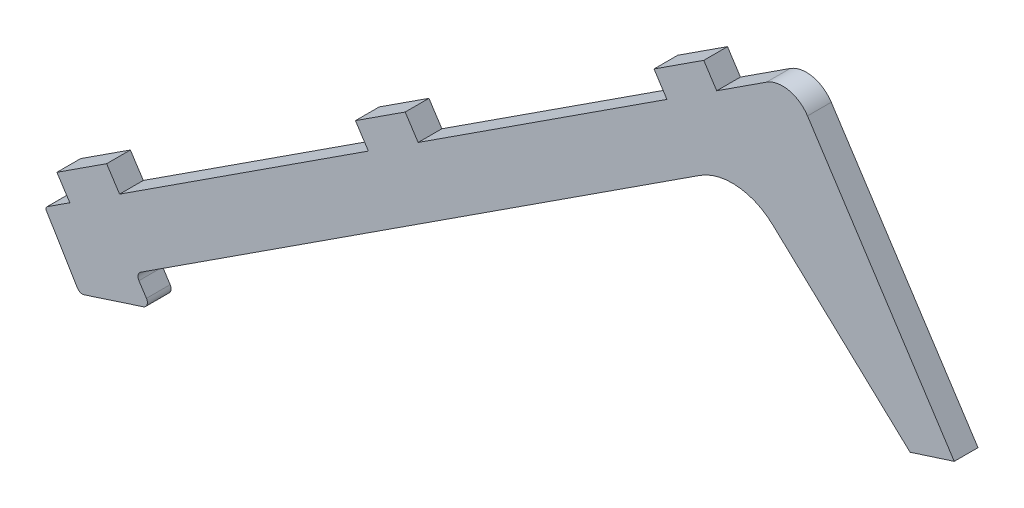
ISO-10303-21;
HEADER;
FILE_DESCRIPTION(('STEP AP214'),'2;1');
FILE_NAME('part.step','',(''),(''),'','','');
FILE_SCHEMA(('AUTOMOTIVE_DESIGN { 1 0 10303 214 1 1 1 1 }'));
ENDSEC;
DATA;
#1=APPLICATION_CONTEXT('core data for automotive mechanical design processes');
#2=APPLICATION_PROTOCOL_DEFINITION('international standard','automotive_design',2000,#1);
#3=PRODUCT_CONTEXT('',#1,'mechanical');
#4=PRODUCT('Part','Part','',(#3));
#5=PRODUCT_RELATED_PRODUCT_CATEGORY('part','',(#4));
#6=PRODUCT_DEFINITION_FORMATION('','',#4);
#7=PRODUCT_DEFINITION_CONTEXT('part definition',#1,'design');
#8=PRODUCT_DEFINITION('design','',#6,#7);
#9=PRODUCT_DEFINITION_SHAPE('','',#8);
#10=(LENGTH_UNIT() NAMED_UNIT(*) SI_UNIT(.MILLI.,.METRE.));
#11=(NAMED_UNIT(*) PLANE_ANGLE_UNIT() SI_UNIT($,.RADIAN.));
#12=(NAMED_UNIT(*) SI_UNIT($,.STERADIAN.) SOLID_ANGLE_UNIT());
#13=UNCERTAINTY_MEASURE_WITH_UNIT(LENGTH_MEASURE(1.E-05),#10,'distance_accuracy_value','');
#14=(GEOMETRIC_REPRESENTATION_CONTEXT(3) GLOBAL_UNCERTAINTY_ASSIGNED_CONTEXT((#13)) GLOBAL_UNIT_ASSIGNED_CONTEXT((#10,
#11,#12)) REPRESENTATION_CONTEXT('',''));
#15=CARTESIAN_POINT('',(0.,0.,0.));
#16=DIRECTION('',(0.,0.,1.));
#17=DIRECTION('',(1.,0.,0.));
#18=AXIS2_PLACEMENT_3D('',#15,#16,#17);
#19=CARTESIAN_POINT('',(141.204421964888,60.2777769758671,8.));
#20=DIRECTION('',(0.,0.,-1.));
#21=DIRECTION('',(-1.,0.,0.));
#22=AXIS2_PLACEMENT_3D('',#19,#20,#21);
#23=CYLINDRICAL_SURFACE('',#22,20.0000000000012);
#24=CARTESIAN_POINT('',(141.204421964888,60.2777769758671,0.));
#25=DIRECTION('',(0.,0.,-1.));
#26=DIRECTION('',(-1.,0.,0.));
#27=AXIS2_PLACEMENT_3D('',#24,#25,#26);
#28=CIRCLE('',#27,20.0000000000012);
#29=CARTESIAN_POINT('',(130.30586040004,77.0474327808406,0.));
#30=VERTEX_POINT('',#29);
#31=CARTESIAN_POINT('',(154.853758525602,74.8961083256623,0.));
#32=VERTEX_POINT('',#31);
#33=EDGE_CURVE('E237',#30,#32,#28,.T.);
#34=ORIENTED_EDGE('',*,*,#33,.T.);
#35=DIRECTION('',(0.,0.,-1.));
#36=VECTOR('',#35,1.);
#37=CARTESIAN_POINT('',(154.853758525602,74.8961083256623,8.));
#38=LINE('',#37,#36);
#39=CARTESIAN_POINT('',(154.853758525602,74.8961083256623,8.));
#40=VERTEX_POINT('',#39);
#41=EDGE_CURVE('E11',#40,#32,#38,.T.);
#42=ORIENTED_EDGE('',*,*,#41,.F.);
#43=CARTESIAN_POINT('',(141.204421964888,60.2777769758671,8.));
#44=DIRECTION('',(0.,0.,-1.));
#45=DIRECTION('',(-1.,0.,0.));
#46=AXIS2_PLACEMENT_3D('',#43,#44,#45);
#47=CIRCLE('',#46,20.0000000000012);
#48=CARTESIAN_POINT('',(130.30586040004,77.0474327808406,8.));
#49=VERTEX_POINT('',#48);
#50=EDGE_CURVE('E288',#49,#40,#47,.T.);
#51=ORIENTED_EDGE('',*,*,#50,.F.);
#52=DIRECTION('',(0.,0.,-1.));
#53=VECTOR('',#52,1.);
#54=CARTESIAN_POINT('',(130.30586040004,77.0474327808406,8.));
#55=LINE('',#54,#53);
#56=EDGE_CURVE('E233',#49,#30,#55,.T.);
#57=ORIENTED_EDGE('',*,*,#56,.T.);
#58=EDGE_LOOP('',(#34,#42,#51,#57));
#59=FACE_BOUND('',#58,.T.);
#60=ADVANCED_FACE('F32',(#59),#23,.F.);
#61=CARTESIAN_POINT('',(196.031751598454,36.4476511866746,8.));
#62=DIRECTION('',(0.682466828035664,0.730916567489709,0.));
#63=DIRECTION('',(-0.730916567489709,0.682466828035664,0.));
#64=AXIS2_PLACEMENT_3D('',#61,#62,#63);
#65=PLANE('',#64);
#66=DIRECTION('',(0.730916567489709,-0.682466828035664,0.));
#67=VECTOR('',#66,1.);
#68=CARTESIAN_POINT('',(196.031751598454,36.4476511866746,0.));
#69=LINE('',#68,#67);
#70=CARTESIAN_POINT('',(201.148167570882,31.670383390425,0.));
#71=VERTEX_POINT('',#70);
#72=EDGE_CURVE('E240',#32,#71,#69,.T.);
#73=ORIENTED_EDGE('',*,*,#72,.T.);
#74=DIRECTION('',(0.,0.,-1.));
#75=VECTOR('',#74,1.);
#76=CARTESIAN_POINT('',(201.148167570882,31.670383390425,8.));
#77=LINE('',#76,#75);
#78=CARTESIAN_POINT('',(201.148167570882,31.670383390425,8.));
#79=VERTEX_POINT('',#78);
#80=EDGE_CURVE('E40',#79,#71,#77,.T.);
#81=ORIENTED_EDGE('',*,*,#80,.F.);
#82=DIRECTION('',(0.730916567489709,-0.682466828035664,0.));
#83=VECTOR('',#82,1.);
#84=CARTESIAN_POINT('',(154.853758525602,74.8961083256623,8.));
#85=LINE('',#84,#83);
#86=EDGE_CURVE('E143',#40,#79,#85,.T.);
#87=ORIENTED_EDGE('',*,*,#86,.F.);
#88=ORIENTED_EDGE('',*,*,#41,.T.);
#89=EDGE_LOOP('',(#73,#81,#87,#88));
#90=FACE_BOUND('',#89,.T.);
#91=ADVANCED_FACE('F426',(#90),#65,.F.);
#92=CARTESIAN_POINT('',(201.148167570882,31.670383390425,8.));
#93=DIRECTION('',(-0.305618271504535,0.95215412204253,0.));
#94=DIRECTION('',(-0.95215412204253,-0.305618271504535,0.));
#95=AXIS2_PLACEMENT_3D('',#92,#93,#94);
#96=PLANE('',#95);
#97=DIRECTION('',(0.95215412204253,0.305618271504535,0.));
#98=VECTOR('',#97,1.);
#99=CARTESIAN_POINT('',(201.148167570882,31.670383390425,0.));
#100=LINE('',#99,#98);
#101=CARTESIAN_POINT('',(216.031751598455,36.4476511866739,0.));
#102=VERTEX_POINT('',#101);
#103=EDGE_CURVE('E242',#71,#102,#100,.T.);
#104=ORIENTED_EDGE('',*,*,#103,.T.);
#105=DIRECTION('',(0.,0.,-1.));
#106=VECTOR('',#105,1.);
#107=CARTESIAN_POINT('',(216.031751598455,36.4476511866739,8.));
#108=LINE('',#107,#106);
#109=CARTESIAN_POINT('',(216.031751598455,36.4476511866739,8.));
#110=VERTEX_POINT('',#109);
#111=EDGE_CURVE('E349',#110,#102,#108,.T.);
#112=ORIENTED_EDGE('',*,*,#111,.F.);
#113=DIRECTION('',(0.95215412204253,0.305618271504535,0.));
#114=VECTOR('',#113,1.);
#115=CARTESIAN_POINT('',(201.148167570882,31.670383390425,8.));
#116=LINE('',#115,#114);
#117=EDGE_CURVE('E357',#79,#110,#116,.T.);
#118=ORIENTED_EDGE('',*,*,#117,.F.);
#119=ORIENTED_EDGE('',*,*,#80,.T.);
#120=EDGE_LOOP('',(#104,#112,#118,#119));
#121=FACE_BOUND('',#120,.T.);
#122=ADVANCED_FACE('F355',(#121),#96,.F.);
#123=CARTESIAN_POINT('',(166.575897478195,112.545551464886,8.));
#124=DIRECTION('',(-0.838482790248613,-0.54492807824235,0.));
#125=DIRECTION('',(0.54492807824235,-0.838482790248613,0.));
#126=AXIS2_PLACEMENT_3D('',#123,#124,#125);
#127=PLANE('',#126);
#128=DIRECTION('',(-0.54492807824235,0.838482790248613,0.));
#129=VECTOR('',#128,1.);
#130=CARTESIAN_POINT('',(166.575897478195,112.545551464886,0.));
#131=LINE('',#130,#129);
#132=CARTESIAN_POINT('',(166.575897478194,112.545551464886,0.));
#133=VERTEX_POINT('',#132);
#134=EDGE_CURVE('E244',#102,#133,#131,.T.);
#135=ORIENTED_EDGE('',*,*,#134,.T.);
#136=DIRECTION('',(0.,0.,-1.));
#137=VECTOR('',#136,1.);
#138=CARTESIAN_POINT('',(166.575897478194,112.545551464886,8.));
#139=LINE('',#138,#137);
#140=CARTESIAN_POINT('',(166.575897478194,112.545551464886,8.));
#141=VERTEX_POINT('',#140);
#142=EDGE_CURVE('E346',#141,#133,#139,.T.);
#143=ORIENTED_EDGE('',*,*,#142,.F.);
#144=DIRECTION('',(-0.54492807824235,0.838482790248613,0.));
#145=VECTOR('',#144,1.);
#146=CARTESIAN_POINT('',(166.575897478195,112.545551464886,8.));
#147=LINE('',#146,#145);
#148=EDGE_CURVE('E373',#110,#141,#147,.T.);
#149=ORIENTED_EDGE('',*,*,#148,.F.);
#150=ORIENTED_EDGE('',*,*,#111,.T.);
#151=EDGE_LOOP('',(#135,#143,#149,#150));
#152=FACE_BOUND('',#151,.T.);
#153=ADVANCED_FACE('F364',(#152),#127,.F.);
#154=CARTESIAN_POINT('',(158.191069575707,107.096270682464,8.));
#155=DIRECTION('',(0.,0.,-1.));
#156=DIRECTION('',(-1.,0.,0.));
#157=AXIS2_PLACEMENT_3D('',#154,#155,#156);
#158=CYLINDRICAL_SURFACE('',#157,9.99999999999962);
#159=CARTESIAN_POINT('',(158.191069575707,107.096270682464,0.));
#160=DIRECTION('',(0.,0.,1.));
#161=DIRECTION('',(-1.,0.,0.));
#162=AXIS2_PLACEMENT_3D('',#159,#160,#161);
#163=CIRCLE('',#162,9.99999999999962);
#164=CARTESIAN_POINT('',(152.741788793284,115.481098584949,0.));
#165=VERTEX_POINT('',#164);
#166=EDGE_CURVE('E246',#133,#165,#163,.T.);
#167=ORIENTED_EDGE('',*,*,#166,.T.);
#168=DIRECTION('',(0.,0.,-1.));
#169=VECTOR('',#168,1.);
#170=CARTESIAN_POINT('',(152.741788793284,115.481098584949,8.));
#171=LINE('',#170,#169);
#172=CARTESIAN_POINT('',(152.741788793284,115.481098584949,8.));
#173=VERTEX_POINT('',#172);
#174=EDGE_CURVE('E343',#173,#165,#171,.T.);
#175=ORIENTED_EDGE('',*,*,#174,.F.);
#176=CARTESIAN_POINT('',(158.191069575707,107.096270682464,8.));
#177=DIRECTION('',(0.,0.,1.));
#178=DIRECTION('',(-1.,0.,0.));
#179=AXIS2_PLACEMENT_3D('',#176,#177,#178);
#180=CIRCLE('',#179,9.99999999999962);
#181=EDGE_CURVE('E370',#141,#173,#180,.T.);
#182=ORIENTED_EDGE('',*,*,#181,.F.);
#183=ORIENTED_EDGE('',*,*,#142,.T.);
#184=EDGE_LOOP('',(#167,#175,#182,#183));
#185=FACE_BOUND('',#184,.T.);
#186=ADVANCED_FACE('F368',(#185),#158,.T.);
#187=CARTESIAN_POINT('',(152.741788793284,115.481098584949,8.));
#188=DIRECTION('',(0.544928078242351,-0.838482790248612,0.));
#189=DIRECTION('',(0.838482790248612,0.544928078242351,0.));
#190=AXIS2_PLACEMENT_3D('',#187,#188,#189);
#191=PLANE('',#190);
#192=DIRECTION('',(-0.838482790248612,-0.544928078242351,0.));
#193=VECTOR('',#192,1.);
#194=CARTESIAN_POINT('',(152.741788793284,115.481098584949,0.));
#195=LINE('',#194,#193);
#196=CARTESIAN_POINT('',(135.972132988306,104.582537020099,0.));
#197=VERTEX_POINT('',#196);
#198=EDGE_CURVE('E248',#165,#197,#195,.T.);
#199=ORIENTED_EDGE('',*,*,#198,.T.);
#200=DIRECTION('',(0.,0.,-1.));
#201=VECTOR('',#200,1.);
#202=CARTESIAN_POINT('',(135.972132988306,104.582537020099,8.));
#203=LINE('',#202,#201);
#204=CARTESIAN_POINT('',(135.972132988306,104.582537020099,8.));
#205=VERTEX_POINT('',#204);
#206=EDGE_CURVE('E340',#205,#197,#203,.T.);
#207=ORIENTED_EDGE('',*,*,#206,.F.);
#208=DIRECTION('',(-0.838482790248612,-0.544928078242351,0.));
#209=VECTOR('',#208,1.);
#210=CARTESIAN_POINT('',(152.741788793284,115.481098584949,8.));
#211=LINE('',#210,#209);
#212=EDGE_CURVE('E372',#173,#205,#211,.T.);
#213=ORIENTED_EDGE('',*,*,#212,.F.);
#214=ORIENTED_EDGE('',*,*,#174,.T.);
#215=EDGE_LOOP('',(#199,#207,#213,#214));
#216=FACE_BOUND('',#215,.T.);
#217=ADVANCED_FACE('F438',(#216),#191,.F.);
#218=CARTESIAN_POINT('',(135.972132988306,104.582537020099,8.));
#219=DIRECTION('',(-0.838482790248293,-0.544928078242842,0.));
#220=DIRECTION('',(0.544928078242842,-0.838482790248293,0.));
#221=AXIS2_PLACEMENT_3D('',#218,#219,#220);
#222=PLANE('',#221);
#223=DIRECTION('',(-0.544928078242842,0.838482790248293,0.));
#224=VECTOR('',#223,1.);
#225=CARTESIAN_POINT('',(135.972132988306,104.582537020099,0.));
#226=LINE('',#225,#224);
#227=CARTESIAN_POINT('',(131.612708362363,111.290399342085,0.));
#228=VERTEX_POINT('',#227);
#229=EDGE_CURVE('E250',#197,#228,#226,.T.);
#230=ORIENTED_EDGE('',*,*,#229,.T.);
#231=DIRECTION('',(0.,0.,-1.));
#232=VECTOR('',#231,1.);
#233=CARTESIAN_POINT('',(131.612708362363,111.290399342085,8.));
#234=LINE('',#233,#232);
#235=CARTESIAN_POINT('',(131.612708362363,111.290399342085,8.));
#236=VERTEX_POINT('',#235);
#237=EDGE_CURVE('E337',#236,#228,#234,.T.);
#238=ORIENTED_EDGE('',*,*,#237,.F.);
#239=DIRECTION('',(-0.544928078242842,0.838482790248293,0.));
#240=VECTOR('',#239,1.);
#241=CARTESIAN_POINT('',(135.972132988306,104.582537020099,8.));
#242=LINE('',#241,#240);
#243=EDGE_CURVE('E375',#205,#236,#242,.T.);
#244=ORIENTED_EDGE('',*,*,#243,.F.);
#245=ORIENTED_EDGE('',*,*,#206,.T.);
#246=EDGE_LOOP('',(#230,#238,#244,#245));
#247=FACE_BOUND('',#246,.T.);
#248=ADVANCED_FACE('F441',(#247),#222,.F.);
#249=CARTESIAN_POINT('',(131.612708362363,111.290399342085,8.));
#250=DIRECTION('',(0.544928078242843,-0.838482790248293,0.));
#251=DIRECTION('',(0.838482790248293,0.544928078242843,0.));
#252=AXIS2_PLACEMENT_3D('',#249,#250,#251);
#253=PLANE('',#252);
#254=DIRECTION('',(-0.838482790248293,-0.544928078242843,0.));
#255=VECTOR('',#254,1.);
#256=CARTESIAN_POINT('',(131.612708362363,111.290399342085,0.));
#257=LINE('',#256,#255);
#258=CARTESIAN_POINT('',(114.843052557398,100.391837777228,0.));
#259=VERTEX_POINT('',#258);
#260=EDGE_CURVE('E252',#228,#259,#257,.T.);
#261=ORIENTED_EDGE('',*,*,#260,.T.);
#262=DIRECTION('',(0.,0.,-1.));
#263=VECTOR('',#262,1.);
#264=CARTESIAN_POINT('',(114.843052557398,100.391837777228,8.));
#265=LINE('',#264,#263);
#266=CARTESIAN_POINT('',(114.843052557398,100.391837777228,8.));
#267=VERTEX_POINT('',#266);
#268=EDGE_CURVE('E334',#267,#259,#265,.T.);
#269=ORIENTED_EDGE('',*,*,#268,.F.);
#270=DIRECTION('',(-0.838482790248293,-0.544928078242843,0.));
#271=VECTOR('',#270,1.);
#272=CARTESIAN_POINT('',(131.612708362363,111.290399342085,8.));
#273=LINE('',#272,#271);
#274=EDGE_CURVE('E381',#236,#267,#273,.T.);
#275=ORIENTED_EDGE('',*,*,#274,.F.);
#276=ORIENTED_EDGE('',*,*,#237,.T.);
#277=EDGE_LOOP('',(#261,#269,#275,#276));
#278=FACE_BOUND('',#277,.T.);
#279=ADVANCED_FACE('F445',(#278),#253,.F.);
#280=CARTESIAN_POINT('',(114.843052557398,100.391837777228,8.));
#281=DIRECTION('',(0.838482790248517,0.544928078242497,0.));
#282=DIRECTION('',(-0.544928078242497,0.838482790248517,0.));
#283=AXIS2_PLACEMENT_3D('',#280,#281,#282);
#284=PLANE('',#283);
#285=DIRECTION('',(0.544928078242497,-0.838482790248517,0.));
#286=VECTOR('',#285,1.);
#287=CARTESIAN_POINT('',(114.843052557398,100.391837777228,0.));
#288=LINE('',#287,#286);
#289=CARTESIAN_POINT('',(119.202477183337,93.6839754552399,0.));
#290=VERTEX_POINT('',#289);
#291=EDGE_CURVE('E254',#259,#290,#288,.T.);
#292=ORIENTED_EDGE('',*,*,#291,.T.);
#293=DIRECTION('',(0.,0.,-1.));
#294=VECTOR('',#293,1.);
#295=CARTESIAN_POINT('',(119.202477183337,93.6839754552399,8.));
#296=LINE('',#295,#294);
#297=CARTESIAN_POINT('',(119.202477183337,93.6839754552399,8.));
#298=VERTEX_POINT('',#297);
#299=EDGE_CURVE('E331',#298,#290,#296,.T.);
#300=ORIENTED_EDGE('',*,*,#299,.F.);
#301=DIRECTION('',(0.544928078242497,-0.838482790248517,0.));
#302=VECTOR('',#301,1.);
#303=CARTESIAN_POINT('',(114.843052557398,100.391837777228,8.));
#304=LINE('',#303,#302);
#305=EDGE_CURVE('E383',#267,#298,#304,.T.);
#306=ORIENTED_EDGE('',*,*,#305,.F.);
#307=ORIENTED_EDGE('',*,*,#268,.T.);
#308=EDGE_LOOP('',(#292,#300,#306,#307));
#309=FACE_BOUND('',#308,.T.);
#310=ADVANCED_FACE('F449',(#309),#284,.F.);
#311=CARTESIAN_POINT('',(35.3541981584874,39.1911676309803,8.));
#312=DIRECTION('',(0.544928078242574,-0.838482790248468,0.));
#313=DIRECTION('',(0.838482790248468,0.544928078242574,0.));
#314=AXIS2_PLACEMENT_3D('',#311,#312,#313);
#315=PLANE('',#314);
#316=DIRECTION('',(-0.838482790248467,-0.544928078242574,0.));
#317=VECTOR('',#316,1.);
#318=CARTESIAN_POINT('',(35.3541981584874,39.1911676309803,0.));
#319=LINE('',#318,#317);
#320=CARTESIAN_POINT('',(35.3541981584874,39.1911676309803,0.));
#321=VERTEX_POINT('',#320);
#322=EDGE_CURVE('E256',#290,#321,#319,.T.);
#323=ORIENTED_EDGE('',*,*,#322,.T.);
#324=DIRECTION('',(0.,0.,-1.));
#325=VECTOR('',#324,1.);
#326=CARTESIAN_POINT('',(35.3541981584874,39.1911676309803,8.));
#327=LINE('',#326,#325);
#328=CARTESIAN_POINT('',(35.3541981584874,39.1911676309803,8.));
#329=VERTEX_POINT('',#328);
#330=EDGE_CURVE('E328',#329,#321,#327,.T.);
#331=ORIENTED_EDGE('',*,*,#330,.F.);
#332=DIRECTION('',(-0.838482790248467,-0.544928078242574,0.));
#333=VECTOR('',#332,1.);
#334=CARTESIAN_POINT('',(35.3541981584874,39.1911676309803,8.));
#335=LINE('',#334,#333);
#336=EDGE_CURVE('E385',#298,#329,#335,.T.);
#337=ORIENTED_EDGE('',*,*,#336,.F.);
#338=ORIENTED_EDGE('',*,*,#299,.T.);
#339=EDGE_LOOP('',(#323,#331,#337,#338));
#340=FACE_BOUND('',#339,.T.);
#341=ADVANCED_FACE('F453',(#340),#315,.F.);
#342=CARTESIAN_POINT('',(35.3541981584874,39.1911676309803,8.));
#343=DIRECTION('',(-0.838482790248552,-0.544928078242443,0.));
#344=DIRECTION('',(0.544928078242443,-0.838482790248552,0.));
#345=AXIS2_PLACEMENT_3D('',#342,#343,#344);
#346=PLANE('',#345);
#347=DIRECTION('',(-0.544928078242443,0.838482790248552,0.));
#348=VECTOR('',#347,1.);
#349=CARTESIAN_POINT('',(35.3541981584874,39.1911676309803,0.));
#350=LINE('',#349,#348);
#351=CARTESIAN_POINT('',(30.9947735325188,45.8990299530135,0.));
#352=VERTEX_POINT('',#351);
#353=EDGE_CURVE('E258',#321,#352,#350,.T.);
#354=ORIENTED_EDGE('',*,*,#353,.T.);
#355=DIRECTION('',(0.,0.,-1.));
#356=VECTOR('',#355,1.);
#357=CARTESIAN_POINT('',(30.9947735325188,45.8990299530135,8.));
#358=LINE('',#357,#356);
#359=CARTESIAN_POINT('',(30.9947735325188,45.8990299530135,8.));
#360=VERTEX_POINT('',#359);
#361=EDGE_CURVE('E325',#360,#352,#358,.T.);
#362=ORIENTED_EDGE('',*,*,#361,.F.);
#363=DIRECTION('',(-0.544928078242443,0.838482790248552,0.));
#364=VECTOR('',#363,1.);
#365=CARTESIAN_POINT('',(35.3541981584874,39.1911676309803,8.));
#366=LINE('',#365,#364);
#367=EDGE_CURVE('E387',#329,#360,#366,.T.);
#368=ORIENTED_EDGE('',*,*,#367,.F.);
#369=ORIENTED_EDGE('',*,*,#330,.T.);
#370=EDGE_LOOP('',(#354,#362,#368,#369));
#371=FACE_BOUND('',#370,.T.);
#372=ADVANCED_FACE('F457',(#371),#346,.F.);
#373=CARTESIAN_POINT('',(30.9947735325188,45.8990299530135,8.));
#374=DIRECTION('',(0.544928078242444,-0.838482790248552,0.));
#375=DIRECTION('',(0.838482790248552,0.544928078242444,0.));
#376=AXIS2_PLACEMENT_3D('',#373,#374,#375);
#377=PLANE('',#376);
#378=DIRECTION('',(-0.838482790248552,-0.544928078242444,0.));
#379=VECTOR('',#378,1.);
#380=CARTESIAN_POINT('',(30.9947735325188,45.8990299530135,0.));
#381=LINE('',#380,#379);
#382=CARTESIAN_POINT('',(14.2251177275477,35.0004683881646,0.));
#383=VERTEX_POINT('',#382);
#384=EDGE_CURVE('E260',#352,#383,#381,.T.);
#385=ORIENTED_EDGE('',*,*,#384,.T.);
#386=DIRECTION('',(0.,0.,-1.));
#387=VECTOR('',#386,1.);
#388=CARTESIAN_POINT('',(14.2251177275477,35.0004683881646,8.));
#389=LINE('',#388,#387);
#390=CARTESIAN_POINT('',(14.2251177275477,35.0004683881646,8.));
#391=VERTEX_POINT('',#390);
#392=EDGE_CURVE('E322',#391,#383,#389,.T.);
#393=ORIENTED_EDGE('',*,*,#392,.F.);
#394=DIRECTION('',(-0.838482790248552,-0.544928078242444,0.));
#395=VECTOR('',#394,1.);
#396=CARTESIAN_POINT('',(30.9947735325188,45.8990299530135,8.));
#397=LINE('',#396,#395);
#398=EDGE_CURVE('E389',#360,#391,#397,.T.);
#399=ORIENTED_EDGE('',*,*,#398,.F.);
#400=ORIENTED_EDGE('',*,*,#361,.T.);
#401=EDGE_LOOP('',(#385,#393,#399,#400));
#402=FACE_BOUND('',#401,.T.);
#403=ADVANCED_FACE('F461',(#402),#377,.F.);
#404=CARTESIAN_POINT('',(14.2251177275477,35.0004683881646,8.));
#405=DIRECTION('',(0.83848279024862,0.54492807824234,0.));
#406=DIRECTION('',(-0.544928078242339,0.83848279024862,0.));
#407=AXIS2_PLACEMENT_3D('',#404,#405,#406);
#408=PLANE('',#407);
#409=DIRECTION('',(0.54492807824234,-0.83848279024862,0.));
#410=VECTOR('',#409,1.);
#411=CARTESIAN_POINT('',(14.2251177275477,35.0004683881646,0.));
#412=LINE('',#411,#410);
#413=CARTESIAN_POINT('',(18.5845423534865,28.2926060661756,0.));
#414=VERTEX_POINT('',#413);
#415=EDGE_CURVE('E262',#383,#414,#412,.T.);
#416=ORIENTED_EDGE('',*,*,#415,.T.);
#417=DIRECTION('',(0.,0.,-1.));
#418=VECTOR('',#417,1.);
#419=CARTESIAN_POINT('',(18.5845423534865,28.2926060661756,8.));
#420=LINE('',#419,#418);
#421=CARTESIAN_POINT('',(18.5845423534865,28.2926060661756,8.));
#422=VERTEX_POINT('',#421);
#423=EDGE_CURVE('E319',#422,#414,#420,.T.);
#424=ORIENTED_EDGE('',*,*,#423,.F.);
#425=DIRECTION('',(0.54492807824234,-0.83848279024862,0.));
#426=VECTOR('',#425,1.);
#427=CARTESIAN_POINT('',(14.2251177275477,35.0004683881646,8.));
#428=LINE('',#427,#426);
#429=EDGE_CURVE('E391',#391,#422,#428,.T.);
#430=ORIENTED_EDGE('',*,*,#429,.F.);
#431=ORIENTED_EDGE('',*,*,#392,.T.);
#432=EDGE_LOOP('',(#416,#424,#430,#431));
#433=FACE_BOUND('',#432,.T.);
#434=ADVANCED_FACE('F465',(#433),#408,.F.);
#435=CARTESIAN_POINT('',(-65.2637366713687,-26.2002017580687,8.));
#436=DIRECTION('',(0.544928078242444,-0.838482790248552,0.));
#437=DIRECTION('',(0.838482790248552,0.544928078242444,0.));
#438=AXIS2_PLACEMENT_3D('',#435,#436,#437);
#439=PLANE('',#438);
#440=DIRECTION('',(-0.838482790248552,-0.544928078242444,0.));
#441=VECTOR('',#440,1.);
#442=CARTESIAN_POINT('',(-65.2637366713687,-26.2002017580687,0.));
#443=LINE('',#442,#441);
#444=CARTESIAN_POINT('',(-65.2637366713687,-26.2002017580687,0.));
#445=VERTEX_POINT('',#444);
#446=EDGE_CURVE('E264',#414,#445,#443,.T.);
#447=ORIENTED_EDGE('',*,*,#446,.T.);
#448=DIRECTION('',(0.,0.,-1.));
#449=VECTOR('',#448,1.);
#450=CARTESIAN_POINT('',(-65.2637366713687,-26.2002017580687,8.));
#451=LINE('',#450,#449);
#452=CARTESIAN_POINT('',(-65.2637366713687,-26.2002017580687,8.));
#453=VERTEX_POINT('',#452);
#454=EDGE_CURVE('E316',#453,#445,#451,.T.);
#455=ORIENTED_EDGE('',*,*,#454,.F.);
#456=DIRECTION('',(-0.838482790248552,-0.544928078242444,0.));
#457=VECTOR('',#456,1.);
#458=CARTESIAN_POINT('',(-65.2637366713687,-26.2002017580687,8.));
#459=LINE('',#458,#457);
#460=EDGE_CURVE('E393',#422,#453,#459,.T.);
#461=ORIENTED_EDGE('',*,*,#460,.F.);
#462=ORIENTED_EDGE('',*,*,#423,.T.);
#463=EDGE_LOOP('',(#447,#455,#461,#462));
#464=FACE_BOUND('',#463,.T.);
#465=ADVANCED_FACE('F469',(#464),#439,.F.);
#466=CARTESIAN_POINT('',(-69.6231612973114,-19.4923394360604,8.));
#467=DIRECTION('',(-0.838482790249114,-0.544928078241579,0.));
#468=DIRECTION('',(0.544928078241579,-0.838482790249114,0.));
#469=AXIS2_PLACEMENT_3D('',#466,#467,#468);
#470=PLANE('',#469);
#471=DIRECTION('',(-0.544928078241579,0.838482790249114,0.));
#472=VECTOR('',#471,1.);
#473=CARTESIAN_POINT('',(-69.6231612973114,-19.4923394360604,0.));
#474=LINE('',#473,#472);
#475=CARTESIAN_POINT('',(-69.6231612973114,-19.4923394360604,0.));
#476=VERTEX_POINT('',#475);
#477=EDGE_CURVE('E266',#445,#476,#474,.T.);
#478=ORIENTED_EDGE('',*,*,#477,.T.);
#479=DIRECTION('',(0.,0.,-1.));
#480=VECTOR('',#479,1.);
#481=CARTESIAN_POINT('',(-69.6231612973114,-19.4923394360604,8.));
#482=LINE('',#481,#480);
#483=CARTESIAN_POINT('',(-69.6231612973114,-19.4923394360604,8.));
#484=VERTEX_POINT('',#483);
#485=EDGE_CURVE('E313',#484,#476,#482,.T.);
#486=ORIENTED_EDGE('',*,*,#485,.F.);
#487=DIRECTION('',(-0.544928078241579,0.838482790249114,0.));
#488=VECTOR('',#487,1.);
#489=CARTESIAN_POINT('',(-69.6231612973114,-19.4923394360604,8.));
#490=LINE('',#489,#488);
#491=EDGE_CURVE('E395',#453,#484,#490,.T.);
#492=ORIENTED_EDGE('',*,*,#491,.F.);
#493=ORIENTED_EDGE('',*,*,#454,.T.);
#494=EDGE_LOOP('',(#478,#486,#492,#493));
#495=FACE_BOUND('',#494,.T.);
#496=ADVANCED_FACE('F473',(#495),#470,.F.);
#497=CARTESIAN_POINT('',(-86.3928171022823,-30.3909010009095,8.));
#498=DIRECTION('',(0.544928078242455,-0.838482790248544,0.));
#499=DIRECTION('',(0.838482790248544,0.544928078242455,0.));
#500=AXIS2_PLACEMENT_3D('',#497,#498,#499);
#501=PLANE('',#500);
#502=DIRECTION('',(-0.838482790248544,-0.544928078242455,0.));
#503=VECTOR('',#502,1.);
#504=CARTESIAN_POINT('',(-86.3928171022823,-30.3909010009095,0.));
#505=LINE('',#504,#503);
#506=CARTESIAN_POINT('',(-86.3928171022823,-30.3909010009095,0.));
#507=VERTEX_POINT('',#506);
#508=EDGE_CURVE('E268',#476,#507,#505,.T.);
#509=ORIENTED_EDGE('',*,*,#508,.T.);
#510=DIRECTION('',(0.,0.,-1.));
#511=VECTOR('',#510,1.);
#512=CARTESIAN_POINT('',(-86.3928171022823,-30.3909010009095,8.));
#513=LINE('',#512,#511);
#514=CARTESIAN_POINT('',(-86.3928171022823,-30.3909010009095,8.));
#515=VERTEX_POINT('',#514);
#516=EDGE_CURVE('E310',#515,#507,#513,.T.);
#517=ORIENTED_EDGE('',*,*,#516,.F.);
#518=DIRECTION('',(-0.838482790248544,-0.544928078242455,0.));
#519=VECTOR('',#518,1.);
#520=CARTESIAN_POINT('',(-86.3928171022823,-30.3909010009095,8.));
#521=LINE('',#520,#519);
#522=EDGE_CURVE('E397',#484,#515,#521,.T.);
#523=ORIENTED_EDGE('',*,*,#522,.F.);
#524=ORIENTED_EDGE('',*,*,#485,.T.);
#525=EDGE_LOOP('',(#509,#517,#523,#524));
#526=FACE_BOUND('',#525,.T.);
#527=ADVANCED_FACE('F477',(#526),#501,.F.);
#528=CARTESIAN_POINT('',(-82.0333924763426,-37.0987633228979,8.));
#529=DIRECTION('',(0.838482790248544,0.544928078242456,0.));
#530=DIRECTION('',(-0.544928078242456,0.838482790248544,0.));
#531=AXIS2_PLACEMENT_3D('',#528,#529,#530);
#532=PLANE('',#531);
#533=DIRECTION('',(0.544928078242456,-0.838482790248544,0.));
#534=VECTOR('',#533,1.);
#535=CARTESIAN_POINT('',(-82.0333924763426,-37.0987633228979,0.));
#536=LINE('',#535,#534);
#537=CARTESIAN_POINT('',(-82.0333924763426,-37.0987633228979,0.));
#538=VERTEX_POINT('',#537);
#539=EDGE_CURVE('E270',#507,#538,#536,.T.);
#540=ORIENTED_EDGE('',*,*,#539,.T.);
#541=DIRECTION('',(0.,0.,-1.));
#542=VECTOR('',#541,1.);
#543=CARTESIAN_POINT('',(-82.0333924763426,-37.0987633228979,8.));
#544=LINE('',#543,#542);
#545=CARTESIAN_POINT('',(-82.0333924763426,-37.0987633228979,8.));
#546=VERTEX_POINT('',#545);
#547=EDGE_CURVE('E307',#546,#538,#544,.T.);
#548=ORIENTED_EDGE('',*,*,#547,.F.);
#549=DIRECTION('',(0.544928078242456,-0.838482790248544,0.));
#550=VECTOR('',#549,1.);
#551=CARTESIAN_POINT('',(-82.0333924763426,-37.0987633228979,8.));
#552=LINE('',#551,#550);
#553=EDGE_CURVE('E399',#515,#546,#552,.T.);
#554=ORIENTED_EDGE('',*,*,#553,.F.);
#555=ORIENTED_EDGE('',*,*,#516,.T.);
#556=EDGE_LOOP('',(#540,#548,#554,#555));
#557=FACE_BOUND('',#556,.T.);
#558=ADVANCED_FACE('F481',(#557),#532,.F.);
#559=CARTESIAN_POINT('',(-82.0333924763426,-37.0987633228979,8.));
#560=DIRECTION('',(0.544928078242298,-0.838482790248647,0.));
#561=DIRECTION('',(0.838482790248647,0.544928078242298,0.));
#562=AXIS2_PLACEMENT_3D('',#559,#560,#561);
#563=PLANE('',#562);
#564=DIRECTION('',(-0.838482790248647,-0.544928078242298,0.));
#565=VECTOR('',#564,1.);
#566=CARTESIAN_POINT('',(-82.0333924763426,-37.0987633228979,0.));
#567=LINE('',#566,#565);
#568=CARTESIAN_POINT('',(-89.6073356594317,-42.0210519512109,0.));
#569=VERTEX_POINT('',#568);
#570=EDGE_CURVE('E272',#538,#569,#567,.T.);
#571=ORIENTED_EDGE('',*,*,#570,.T.);
#572=DIRECTION('',(0.,0.,-1.));
#573=VECTOR('',#572,1.);
#574=CARTESIAN_POINT('',(-89.6073356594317,-42.0210519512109,8.));
#575=LINE('',#574,#573);
#576=CARTESIAN_POINT('',(-89.6073356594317,-42.0210519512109,8.));
#577=VERTEX_POINT('',#576);
#578=EDGE_CURVE('E304',#577,#569,#575,.T.);
#579=ORIENTED_EDGE('',*,*,#578,.F.);
#580=DIRECTION('',(-0.838482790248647,-0.544928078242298,0.));
#581=VECTOR('',#580,1.);
#582=CARTESIAN_POINT('',(-82.0333924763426,-37.0987633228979,8.));
#583=LINE('',#582,#581);
#584=EDGE_CURVE('E401',#546,#577,#583,.T.);
#585=ORIENTED_EDGE('',*,*,#584,.F.);
#586=ORIENTED_EDGE('',*,*,#547,.T.);
#587=EDGE_LOOP('',(#571,#579,#585,#586));
#588=FACE_BOUND('',#587,.T.);
#589=ADVANCED_FACE('F485',(#588),#563,.F.);
#590=CARTESIAN_POINT('',(-89.0624075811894,-42.8595347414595,8.));
#591=DIRECTION('',(0.,0.,-1.));
#592=DIRECTION('',(-1.,0.,0.));
#593=AXIS2_PLACEMENT_3D('',#590,#591,#592);
#594=CYLINDRICAL_SURFACE('',#593,0.999999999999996);
#595=CARTESIAN_POINT('',(-89.0624075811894,-42.8595347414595,0.));
#596=DIRECTION('',(0.,0.,1.));
#597=DIRECTION('',(-1.,0.,0.));
#598=AXIS2_PLACEMENT_3D('',#595,#596,#597);
#599=CIRCLE('',#598,0.999999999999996);
#600=CARTESIAN_POINT('',(-89.9186519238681,-43.3761057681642,0.));
#601=VERTEX_POINT('',#600);
#602=EDGE_CURVE('E274',#569,#601,#599,.T.);
#603=ORIENTED_EDGE('',*,*,#602,.T.);
#604=DIRECTION('',(0.,0.,-1.));
#605=VECTOR('',#604,1.);
#606=CARTESIAN_POINT('',(-89.9186519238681,-43.3761057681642,8.));
#607=LINE('',#606,#605);
#608=CARTESIAN_POINT('',(-89.9186519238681,-43.3761057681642,8.));
#609=VERTEX_POINT('',#608);
#610=EDGE_CURVE('E301',#609,#601,#607,.T.);
#611=ORIENTED_EDGE('',*,*,#610,.F.);
#612=CARTESIAN_POINT('',(-89.0624075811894,-42.8595347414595,8.));
#613=DIRECTION('',(0.,0.,1.));
#614=DIRECTION('',(-1.,0.,0.));
#615=AXIS2_PLACEMENT_3D('',#612,#613,#614);
#616=CIRCLE('',#615,0.999999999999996);
#617=EDGE_CURVE('E403',#577,#609,#616,.T.);
#618=ORIENTED_EDGE('',*,*,#617,.F.);
#619=ORIENTED_EDGE('',*,*,#578,.T.);
#620=EDGE_LOOP('',(#603,#611,#618,#619));
#621=FACE_BOUND('',#620,.T.);
#622=ADVANCED_FACE('F489',(#621),#594,.T.);
#623=CARTESIAN_POINT('',(-89.9186519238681,-43.3761057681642,8.));
#624=DIRECTION('',(0.85624434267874,0.516571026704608,0.));
#625=DIRECTION('',(-0.516571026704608,0.85624434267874,0.));
#626=AXIS2_PLACEMENT_3D('',#623,#624,#625);
#627=PLANE('',#626);
#628=DIRECTION('',(0.516571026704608,-0.85624434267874,0.));
#629=VECTOR('',#628,1.);
#630=CARTESIAN_POINT('',(-89.9186519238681,-43.3761057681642,0.));
#631=LINE('',#630,#629);
#632=CARTESIAN_POINT('',(-79.4849197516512,-60.6705796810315,0.));
#633=VERTEX_POINT('',#632);
#634=EDGE_CURVE('E276',#601,#633,#631,.T.);
#635=ORIENTED_EDGE('',*,*,#634,.T.);
#636=DIRECTION('',(0.,0.,-1.));
#637=VECTOR('',#636,1.);
#638=CARTESIAN_POINT('',(-79.4849197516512,-60.6705796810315,8.));
#639=LINE('',#638,#637);
#640=CARTESIAN_POINT('',(-79.4849197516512,-60.6705796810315,8.));
#641=VERTEX_POINT('',#640);
#642=EDGE_CURVE('E298',#641,#633,#639,.T.);
#643=ORIENTED_EDGE('',*,*,#642,.F.);
#644=DIRECTION('',(0.516571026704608,-0.85624434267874,0.));
#645=VECTOR('',#644,1.);
#646=CARTESIAN_POINT('',(-89.9186519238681,-43.3761057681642,8.));
#647=LINE('',#646,#645);
#648=EDGE_CURVE('E405',#609,#641,#647,.T.);
#649=ORIENTED_EDGE('',*,*,#648,.F.);
#650=ORIENTED_EDGE('',*,*,#610,.T.);
#651=EDGE_LOOP('',(#635,#643,#649,#650));
#652=FACE_BOUND('',#651,.T.);
#653=ADVANCED_FACE('F493',(#652),#627,.F.);
#654=CARTESIAN_POINT('',(-77.7724310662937,-59.6374376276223,8.));
#655=DIRECTION('',(0.,0.,-1.));
#656=DIRECTION('',(-1.,0.,0.));
#657=AXIS2_PLACEMENT_3D('',#654,#655,#656);
#658=CYLINDRICAL_SURFACE('',#657,2.);
#659=CARTESIAN_POINT('',(-77.7724310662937,-59.6374376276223,0.));
#660=DIRECTION('',(0.,0.,1.));
#661=DIRECTION('',(1.,0.,0.));
#662=AXIS2_PLACEMENT_3D('',#659,#660,#661);
#663=CIRCLE('',#662,2.);
#664=CARTESIAN_POINT('',(-77.1548966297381,-61.5397129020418,0.));
#665=VERTEX_POINT('',#664);
#666=EDGE_CURVE('E278',#633,#665,#663,.T.);
#667=ORIENTED_EDGE('',*,*,#666,.T.);
#668=DIRECTION('',(0.,0.,-1.));
#669=VECTOR('',#668,1.);
#670=CARTESIAN_POINT('',(-77.1548966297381,-61.5397129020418,8.));
#671=LINE('',#670,#669);
#672=CARTESIAN_POINT('',(-77.1548966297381,-61.5397129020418,8.));
#673=VERTEX_POINT('',#672);
#674=EDGE_CURVE('E295',#673,#665,#671,.T.);
#675=ORIENTED_EDGE('',*,*,#674,.F.);
#676=CARTESIAN_POINT('',(-77.7724310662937,-59.6374376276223,8.));
#677=DIRECTION('',(0.,0.,1.));
#678=DIRECTION('',(1.,0.,0.));
#679=AXIS2_PLACEMENT_3D('',#676,#677,#678);
#680=CIRCLE('',#679,2.);
#681=EDGE_CURVE('E407',#641,#673,#680,.T.);
#682=ORIENTED_EDGE('',*,*,#681,.F.);
#683=ORIENTED_EDGE('',*,*,#642,.T.);
#684=EDGE_LOOP('',(#667,#675,#682,#683));
#685=FACE_BOUND('',#684,.T.);
#686=ADVANCED_FACE('F497',(#685),#658,.T.);
#687=CARTESIAN_POINT('',(-57.2747048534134,-55.0860186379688,8.));
#688=DIRECTION('',(-0.308767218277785,0.951137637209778,0.));
#689=DIRECTION('',(-0.951137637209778,-0.308767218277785,0.));
#690=AXIS2_PLACEMENT_3D('',#687,#688,#689);
#691=PLANE('',#690);
#692=DIRECTION('',(0.951137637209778,0.308767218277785,0.));
#693=VECTOR('',#692,1.);
#694=CARTESIAN_POINT('',(-57.2747048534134,-55.0860186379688,0.));
#695=LINE('',#694,#693);
#696=CARTESIAN_POINT('',(-57.2747048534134,-55.0860186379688,0.));
#697=VERTEX_POINT('',#696);
#698=EDGE_CURVE('E280',#665,#697,#695,.T.);
#699=ORIENTED_EDGE('',*,*,#698,.T.);
#700=DIRECTION('',(0.,0.,-1.));
#701=VECTOR('',#700,1.);
#702=CARTESIAN_POINT('',(-57.2747048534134,-55.0860186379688,8.));
#703=LINE('',#702,#701);
#704=CARTESIAN_POINT('',(-57.2747048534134,-55.0860186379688,8.));
#705=VERTEX_POINT('',#704);
#706=EDGE_CURVE('E292',#705,#697,#703,.T.);
#707=ORIENTED_EDGE('',*,*,#706,.F.);
#708=DIRECTION('',(0.951137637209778,0.308767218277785,0.));
#709=VECTOR('',#708,1.);
#710=CARTESIAN_POINT('',(-57.2747048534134,-55.0860186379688,8.));
#711=LINE('',#710,#709);
#712=EDGE_CURVE('E409',#673,#705,#711,.T.);
#713=ORIENTED_EDGE('',*,*,#712,.F.);
#714=ORIENTED_EDGE('',*,*,#674,.T.);
#715=EDGE_LOOP('',(#699,#707,#713,#714));
#716=FACE_BOUND('',#715,.T.);
#717=ADVANCED_FACE('F415',(#716),#691,.F.);
#718=CARTESIAN_POINT('',(-57.8922392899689,-53.1837433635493,8.));
#719=DIRECTION('',(0.,0.,-1.));
#720=DIRECTION('',(-1.,0.,0.));
#721=AXIS2_PLACEMENT_3D('',#718,#719,#720);
#722=CYLINDRICAL_SURFACE('',#721,2.);
#723=CARTESIAN_POINT('',(-57.8922392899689,-53.1837433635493,0.));
#724=DIRECTION('',(0.,0.,1.));
#725=DIRECTION('',(-1.,0.,0.));
#726=AXIS2_PLACEMENT_3D('',#723,#724,#725);
#727=CIRCLE('',#726,2.);
#728=CARTESIAN_POINT('',(-56.2152737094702,-52.0938872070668,0.));
#729=VERTEX_POINT('',#728);
#730=EDGE_CURVE('E282',#697,#729,#727,.T.);
#731=ORIENTED_EDGE('',*,*,#730,.T.);
#732=DIRECTION('',(0.,0.,-1.));
#733=VECTOR('',#732,1.);
#734=CARTESIAN_POINT('',(-56.2152737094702,-52.0938872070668,8.));
#735=LINE('',#734,#733);
#736=CARTESIAN_POINT('',(-56.2152737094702,-52.0938872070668,8.));
#737=VERTEX_POINT('',#736);
#738=EDGE_CURVE('E228',#737,#729,#735,.T.);
#739=ORIENTED_EDGE('',*,*,#738,.F.);
#740=CARTESIAN_POINT('',(-57.8922392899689,-53.1837433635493,8.));
#741=DIRECTION('',(0.,0.,1.));
#742=DIRECTION('',(-1.,0.,0.));
#743=AXIS2_PLACEMENT_3D('',#740,#741,#742);
#744=CIRCLE('',#743,2.);
#745=EDGE_CURVE('E217',#705,#737,#744,.T.);
#746=ORIENTED_EDGE('',*,*,#745,.F.);
#747=ORIENTED_EDGE('',*,*,#706,.T.);
#748=EDGE_LOOP('',(#731,#739,#746,#747));
#749=FACE_BOUND('',#748,.T.);
#750=ADVANCED_FACE('F419',(#749),#722,.T.);
#751=CARTESIAN_POINT('',(-58.7449231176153,-48.2015065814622,8.));
#752=DIRECTION('',(-0.838482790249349,-0.544928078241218,0.));
#753=DIRECTION('',(0.544928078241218,-0.838482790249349,0.));
#754=AXIS2_PLACEMENT_3D('',#751,#752,#753);
#755=PLANE('',#754);
#756=DIRECTION('',(-0.544928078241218,0.838482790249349,0.));
#757=VECTOR('',#756,1.);
#758=CARTESIAN_POINT('',(-58.7449231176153,-48.2015065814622,0.));
#759=LINE('',#758,#757);
#760=CARTESIAN_POINT('',(-58.7449231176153,-48.2015065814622,0.));
#761=VERTEX_POINT('',#760);
#762=EDGE_CURVE('E226',#729,#761,#759,.T.);
#763=ORIENTED_EDGE('',*,*,#762,.T.);
#764=DIRECTION('',(0.,0.,-1.));
#765=VECTOR('',#764,1.);
#766=CARTESIAN_POINT('',(-58.7449231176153,-48.2015065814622,8.));
#767=LINE('',#766,#765);
#768=CARTESIAN_POINT('',(-58.7449231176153,-48.2015065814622,8.));
#769=VERTEX_POINT('',#768);
#770=EDGE_CURVE('E223',#769,#761,#767,.T.);
#771=ORIENTED_EDGE('',*,*,#770,.F.);
#772=DIRECTION('',(-0.544928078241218,0.838482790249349,0.));
#773=VECTOR('',#772,1.);
#774=CARTESIAN_POINT('',(-58.7449231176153,-48.2015065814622,8.));
#775=LINE('',#774,#773);
#776=EDGE_CURVE('E210',#737,#769,#775,.T.);
#777=ORIENTED_EDGE('',*,*,#776,.F.);
#778=ORIENTED_EDGE('',*,*,#738,.T.);
#779=EDGE_LOOP('',(#763,#771,#777,#778));
#780=FACE_BOUND('',#779,.T.);
#781=ADVANCED_FACE('F224',(#780),#755,.F.);
#782=CARTESIAN_POINT('',(-57.0679575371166,-47.1116504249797,8.));
#783=DIRECTION('',(0.,0.,-1.));
#784=DIRECTION('',(-1.,0.,0.));
#785=AXIS2_PLACEMENT_3D('',#782,#783,#784);
#786=CYLINDRICAL_SURFACE('',#785,2.);
#787=CARTESIAN_POINT('',(-57.0679575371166,-47.1116504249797,0.));
#788=DIRECTION('',(0.,0.,-1.));
#789=DIRECTION('',(-1.,0.,0.));
#790=AXIS2_PLACEMENT_3D('',#787,#788,#789);
#791=CIRCLE('',#790,2.);
#792=CARTESIAN_POINT('',(-58.1578136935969,-45.4346848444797,0.));
#793=VERTEX_POINT('',#792);
#794=EDGE_CURVE('E285',#761,#793,#791,.T.);
#795=ORIENTED_EDGE('',*,*,#794,.T.);
#796=DIRECTION('',(0.,0.,-1.));
#797=VECTOR('',#796,1.);
#798=CARTESIAN_POINT('',(-58.1578136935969,-45.4346848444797,8.));
#799=LINE('',#798,#797);
#800=CARTESIAN_POINT('',(-58.1578136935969,-45.4346848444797,8.));
#801=VERTEX_POINT('',#800);
#802=EDGE_CURVE('E229',#801,#793,#799,.T.);
#803=ORIENTED_EDGE('',*,*,#802,.F.);
#804=CARTESIAN_POINT('',(-57.0679575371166,-47.1116504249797,8.));
#805=DIRECTION('',(0.,0.,-1.));
#806=DIRECTION('',(-1.,0.,0.));
#807=AXIS2_PLACEMENT_3D('',#804,#805,#806);
#808=CIRCLE('',#807,2.);
#809=EDGE_CURVE('E214',#769,#801,#808,.T.);
#810=ORIENTED_EDGE('',*,*,#809,.F.);
#811=ORIENTED_EDGE('',*,*,#770,.T.);
#812=EDGE_LOOP('',(#795,#803,#810,#811));
#813=FACE_BOUND('',#812,.T.);
#814=ADVANCED_FACE('F231',(#813),#786,.F.);
#815=CARTESIAN_POINT('',(39.5353119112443,18.055857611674,8.));
#816=DIRECTION('',(-0.544928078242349,0.838482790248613,0.));
#817=DIRECTION('',(-0.838482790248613,-0.544928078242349,0.));
#818=AXIS2_PLACEMENT_3D('',#815,#816,#817);
#819=PLANE('',#818);
#820=DIRECTION('',(0.838482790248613,0.544928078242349,0.));
#821=VECTOR('',#820,1.);
#822=CARTESIAN_POINT('',(39.5353119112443,18.055857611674,0.));
#823=LINE('',#822,#821);
#824=EDGE_CURVE('E131',#793,#30,#823,.T.);
#825=ORIENTED_EDGE('',*,*,#824,.T.);
#826=ORIENTED_EDGE('',*,*,#56,.F.);
#827=DIRECTION('',(0.83848279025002,0.544928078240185,0.));
#828=VECTOR('',#827,1.);
#829=CARTESIAN_POINT('',(39.5353119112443,18.055857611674,8.));
#830=LINE('',#829,#828);
#831=EDGE_CURVE('E48',#801,#49,#830,.T.);
#832=ORIENTED_EDGE('',*,*,#831,.F.);
#833=ORIENTED_EDGE('',*,*,#802,.T.);
#834=EDGE_LOOP('',(#825,#826,#832,#833));
#835=FACE_BOUND('',#834,.T.);
#836=ADVANCED_FACE('F420',(#835),#819,.F.);
#837=CARTESIAN_POINT('',(141.204421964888,60.2777769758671,8.));
#838=DIRECTION('',(0.,0.,-1.));
#839=DIRECTION('',(-1.,0.,0.));
#840=AXIS2_PLACEMENT_3D('',#837,#838,#839);
#841=PLANE('',#840);
#842=ORIENTED_EDGE('',*,*,#50,.T.);
#843=ORIENTED_EDGE('',*,*,#86,.T.);
#844=ORIENTED_EDGE('',*,*,#117,.T.);
#845=ORIENTED_EDGE('',*,*,#148,.T.);
#846=ORIENTED_EDGE('',*,*,#181,.T.);
#847=ORIENTED_EDGE('',*,*,#212,.T.);
#848=ORIENTED_EDGE('',*,*,#243,.T.);
#849=ORIENTED_EDGE('',*,*,#274,.T.);
#850=ORIENTED_EDGE('',*,*,#305,.T.);
#851=ORIENTED_EDGE('',*,*,#336,.T.);
#852=ORIENTED_EDGE('',*,*,#367,.T.);
#853=ORIENTED_EDGE('',*,*,#398,.T.);
#854=ORIENTED_EDGE('',*,*,#429,.T.);
#855=ORIENTED_EDGE('',*,*,#460,.T.);
#856=ORIENTED_EDGE('',*,*,#491,.T.);
#857=ORIENTED_EDGE('',*,*,#522,.T.);
#858=ORIENTED_EDGE('',*,*,#553,.T.);
#859=ORIENTED_EDGE('',*,*,#584,.T.);
#860=ORIENTED_EDGE('',*,*,#617,.T.);
#861=ORIENTED_EDGE('',*,*,#648,.T.);
#862=ORIENTED_EDGE('',*,*,#681,.T.);
#863=ORIENTED_EDGE('',*,*,#712,.T.);
#864=ORIENTED_EDGE('',*,*,#745,.T.);
#865=ORIENTED_EDGE('',*,*,#776,.T.);
#866=ORIENTED_EDGE('',*,*,#809,.T.);
#867=ORIENTED_EDGE('',*,*,#831,.T.);
#868=EDGE_LOOP('',(#842,#843,#844,#845,#846,#847,#848,#849,#850,#851,#852,#853,#854,#855,#856,
#857,#858,#859,#860,#861,#862,#863,#864,#865,#866,#867));
#869=FACE_BOUND('',#868,.T.);
#870=ADVANCED_FACE('F212',(#869),#841,.F.);
#871=CARTESIAN_POINT('',(141.204421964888,60.2777769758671,0.));
#872=DIRECTION('',(0.,0.,-1.));
#873=DIRECTION('',(-1.,0.,0.));
#874=AXIS2_PLACEMENT_3D('',#871,#872,#873);
#875=PLANE('',#874);
#876=ORIENTED_EDGE('',*,*,#33,.F.);
#877=ORIENTED_EDGE('',*,*,#824,.F.);
#878=ORIENTED_EDGE('',*,*,#794,.F.);
#879=ORIENTED_EDGE('',*,*,#762,.F.);
#880=ORIENTED_EDGE('',*,*,#730,.F.);
#881=ORIENTED_EDGE('',*,*,#698,.F.);
#882=ORIENTED_EDGE('',*,*,#666,.F.);
#883=ORIENTED_EDGE('',*,*,#634,.F.);
#884=ORIENTED_EDGE('',*,*,#602,.F.);
#885=ORIENTED_EDGE('',*,*,#570,.F.);
#886=ORIENTED_EDGE('',*,*,#539,.F.);
#887=ORIENTED_EDGE('',*,*,#508,.F.);
#888=ORIENTED_EDGE('',*,*,#477,.F.);
#889=ORIENTED_EDGE('',*,*,#446,.F.);
#890=ORIENTED_EDGE('',*,*,#415,.F.);
#891=ORIENTED_EDGE('',*,*,#384,.F.);
#892=ORIENTED_EDGE('',*,*,#353,.F.);
#893=ORIENTED_EDGE('',*,*,#322,.F.);
#894=ORIENTED_EDGE('',*,*,#291,.F.);
#895=ORIENTED_EDGE('',*,*,#260,.F.);
#896=ORIENTED_EDGE('',*,*,#229,.F.);
#897=ORIENTED_EDGE('',*,*,#198,.F.);
#898=ORIENTED_EDGE('',*,*,#166,.F.);
#899=ORIENTED_EDGE('',*,*,#134,.F.);
#900=ORIENTED_EDGE('',*,*,#103,.F.);
#901=ORIENTED_EDGE('',*,*,#72,.F.);
#902=EDGE_LOOP('',(#876,#877,#878,#879,#880,#881,#882,#883,#884,#885,#886,#887,#888,#889,#890,
#891,#892,#893,#894,#895,#896,#897,#898,#899,#900,#901));
#903=FACE_BOUND('',#902,.T.);
#904=ADVANCED_FACE('F359',(#903),#875,.T.);
#905=CLOSED_SHELL('',(#60,#91,#122,#153,#186,#217,#248,#279,#310,#341,#372,#403,#434,#465,#496,
#527,#558,#589,#622,#653,#686,#717,#750,#781,#814,#836,#870,#904));
#906=MANIFOLD_SOLID_BREP('B2',#905);
#907=ADVANCED_BREP_SHAPE_REPRESENTATION('',(#18,#906),#14);
#908=SHAPE_DEFINITION_REPRESENTATION(#9,#907);
ENDSEC;
END-ISO-10303-21;
